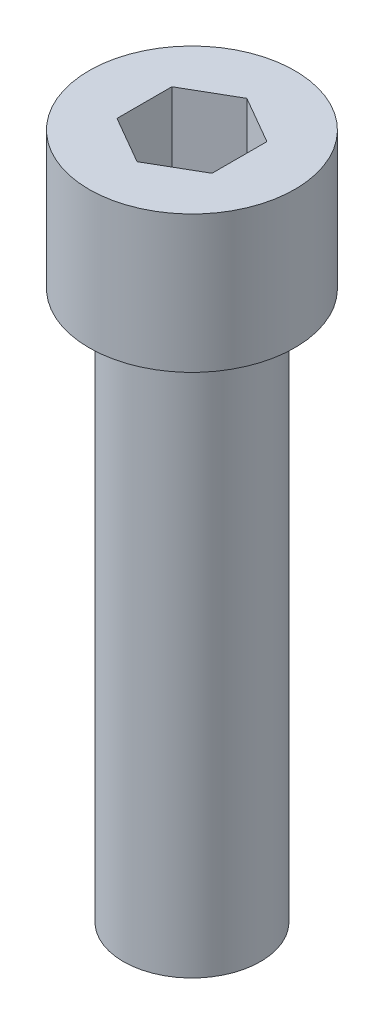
ISO-10303-21;
HEADER;
FILE_DESCRIPTION(('STEP AP214'),'2;1');
FILE_NAME('part.step','',(''),(''),'','','');
FILE_SCHEMA(('AUTOMOTIVE_DESIGN { 1 0 10303 214 1 1 1 1 }'));
ENDSEC;
DATA;
#1=APPLICATION_CONTEXT('core data for automotive mechanical design processes');
#2=APPLICATION_PROTOCOL_DEFINITION('international standard','automotive_design',2000,#1);
#3=PRODUCT_CONTEXT('',#1,'mechanical');
#4=PRODUCT('Part','Part','',(#3));
#5=PRODUCT_RELATED_PRODUCT_CATEGORY('part','',(#4));
#6=PRODUCT_DEFINITION_FORMATION('','',#4);
#7=PRODUCT_DEFINITION_CONTEXT('part definition',#1,'design');
#8=PRODUCT_DEFINITION('design','',#6,#7);
#9=PRODUCT_DEFINITION_SHAPE('','',#8);
#10=(LENGTH_UNIT() NAMED_UNIT(*) SI_UNIT(.MILLI.,.METRE.));
#11=(NAMED_UNIT(*) PLANE_ANGLE_UNIT() SI_UNIT($,.RADIAN.));
#12=(NAMED_UNIT(*) SI_UNIT($,.STERADIAN.) SOLID_ANGLE_UNIT());
#13=UNCERTAINTY_MEASURE_WITH_UNIT(LENGTH_MEASURE(1.E-05),#10,'distance_accuracy_value','');
#14=(GEOMETRIC_REPRESENTATION_CONTEXT(3) GLOBAL_UNCERTAINTY_ASSIGNED_CONTEXT((#13)) GLOBAL_UNIT_ASSIGNED_CONTEXT((#10,
#11,#12)) REPRESENTATION_CONTEXT('',''));
#15=CARTESIAN_POINT('',(0.,0.,0.));
#16=DIRECTION('',(0.,0.,1.));
#17=DIRECTION('',(1.,0.,0.));
#18=AXIS2_PLACEMENT_3D('',#15,#16,#17);
#19=CARTESIAN_POINT('',(-3.17499999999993,-31.7499999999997,-1.73472347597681E-13));
#20=DIRECTION('',(0.,-1.,0.));
#21=DIRECTION('',(0.,0.,-1.));
#22=AXIS2_PLACEMENT_3D('',#19,#20,#21);
#23=PLANE('',#22);
#24=CARTESIAN_POINT('',(0.,-31.7499999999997,0.));
#25=DIRECTION('',(0.,1.,0.));
#26=DIRECTION('',(0.,0.,1.));
#27=AXIS2_PLACEMENT_3D('',#24,#25,#26);
#28=CIRCLE('',#27,3.17499999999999);
#29=CARTESIAN_POINT('',(0.,-31.7499999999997,3.17500000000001));
#30=VERTEX_POINT('',#29);
#31=EDGE_CURVE('E11',#30,#30,#28,.T.);
#32=ORIENTED_EDGE('',*,*,#31,.F.);
#33=EDGE_LOOP('',(#32));
#34=FACE_BOUND('',#33,.T.);
#35=ADVANCED_FACE('F34',(#34),#23,.T.);
#36=CARTESIAN_POINT('',(1.80411241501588E-13,66.04,-2.28983498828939E-13));
#37=DIRECTION('',(0.,1.,0.));
#38=DIRECTION('',(0.,0.,1.));
#39=AXIS2_PLACEMENT_3D('',#36,#37,#38);
#40=CYLINDRICAL_SURFACE('',#39,3.17499999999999);
#41=ORIENTED_EDGE('',*,*,#31,.T.);
#42=EDGE_LOOP('',(#41));
#43=FACE_BOUND('',#42,.T.);
#44=CARTESIAN_POINT('',(1.11022302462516E-13,-6.3500000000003,0.));
#45=DIRECTION('',(0.,1.,0.));
#46=DIRECTION('',(0.,0.,1.));
#47=AXIS2_PLACEMENT_3D('',#44,#45,#46);
#48=CIRCLE('',#47,3.17499999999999);
#49=CARTESIAN_POINT('',(1.08554831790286E-13,-6.3500000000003,3.17500000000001));
#50=VERTEX_POINT('',#49);
#51=EDGE_CURVE('E41',#50,#50,#48,.T.);
#52=ORIENTED_EDGE('',*,*,#51,.F.);
#53=EDGE_LOOP('',(#52));
#54=FACE_BOUND('',#53,.T.);
#55=ADVANCED_FACE('F153',(#43,#54),#40,.T.);
#56=CARTESIAN_POINT('',(-4.76249999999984,-6.3500000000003,-1.2490009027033E-13));
#57=DIRECTION('',(0.,-1.,0.));
#58=DIRECTION('',(0.,0.,-1.));
#59=AXIS2_PLACEMENT_3D('',#56,#57,#58);
#60=PLANE('',#59);
#61=ORIENTED_EDGE('',*,*,#51,.T.);
#62=EDGE_LOOP('',(#61));
#63=FACE_BOUND('',#62,.T.);
#64=CARTESIAN_POINT('',(1.11022302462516E-13,-6.3500000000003,0.));
#65=DIRECTION('',(0.,1.,0.));
#66=DIRECTION('',(0.,0.,1.));
#67=AXIS2_PLACEMENT_3D('',#64,#65,#66);
#68=CIRCLE('',#67,4.76249999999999);
#69=CARTESIAN_POINT('',(1.07321096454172E-13,-6.3500000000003,4.76250000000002));
#70=VERTEX_POINT('',#69);
#71=EDGE_CURVE('E145',#70,#70,#68,.T.);
#72=ORIENTED_EDGE('',*,*,#71,.F.);
#73=EDGE_LOOP('',(#72));
#74=FACE_BOUND('',#73,.T.);
#75=ADVANCED_FACE('F150',(#63,#74),#60,.T.);
#76=CARTESIAN_POINT('',(1.80411241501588E-13,66.04,-2.28983498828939E-13));
#77=DIRECTION('',(0.,1.,0.));
#78=DIRECTION('',(0.,0.,1.));
#79=AXIS2_PLACEMENT_3D('',#76,#77,#78);
#80=CYLINDRICAL_SURFACE('',#79,4.76249999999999);
#81=ORIENTED_EDGE('',*,*,#71,.T.);
#82=EDGE_LOOP('',(#81));
#83=FACE_BOUND('',#82,.T.);
#84=CARTESIAN_POINT('',(0.,0.,0.));
#85=DIRECTION('',(0.,1.,0.));
#86=DIRECTION('',(0.,0.,1.));
#87=AXIS2_PLACEMENT_3D('',#84,#85,#86);
#88=CIRCLE('',#87,4.76249999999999);
#89=CARTESIAN_POINT('',(0.,0.,4.76250000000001));
#90=VERTEX_POINT('',#89);
#91=EDGE_CURVE('E136',#90,#90,#88,.T.);
#92=ORIENTED_EDGE('',*,*,#91,.F.);
#93=EDGE_LOOP('',(#92));
#94=FACE_BOUND('',#93,.T.);
#95=ADVANCED_FACE('F160',(#83,#94),#80,.T.);
#96=CARTESIAN_POINT('',(0.,0.,0.));
#97=DIRECTION('',(0.,1.,0.));
#98=DIRECTION('',(0.,0.,1.));
#99=AXIS2_PLACEMENT_3D('',#96,#97,#98);
#100=PLANE('',#99);
#101=DIRECTION('',(-0.866025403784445,0.,-0.499999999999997));
#102=VECTOR('',#101,1.);
#103=CARTESIAN_POINT('',(2.19970452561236,0.,-1.27));
#104=LINE('',#103,#102);
#105=CARTESIAN_POINT('',(2.19970452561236,0.,-1.27));
#106=VERTEX_POINT('',#105);
#107=CARTESIAN_POINT('',(0.,0.,-2.53999999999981));
#108=VERTEX_POINT('',#107);
#109=EDGE_CURVE('E48',#106,#108,#104,.T.);
#110=ORIENTED_EDGE('',*,*,#109,.F.);
#111=DIRECTION('',(0.,0.,-1.));
#112=VECTOR('',#111,1.);
#113=CARTESIAN_POINT('',(2.19970452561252,-2.22044604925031E-13,1.26999999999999));
#114=LINE('',#113,#112);
#115=CARTESIAN_POINT('',(2.19970452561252,-2.22044604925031E-13,1.26999999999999));
#116=VERTEX_POINT('',#115);
#117=EDGE_CURVE('E118',#116,#106,#114,.T.);
#118=ORIENTED_EDGE('',*,*,#117,.F.);
#119=DIRECTION('',(0.866025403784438,0.,-0.500000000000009));
#120=VECTOR('',#119,1.);
#121=CARTESIAN_POINT('',(1.11022302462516E-13,0.,2.53999999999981));
#122=LINE('',#121,#120);
#123=CARTESIAN_POINT('',(1.11022302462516E-13,0.,2.53999999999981));
#124=VERTEX_POINT('',#123);
#125=EDGE_CURVE('E112',#124,#116,#122,.T.);
#126=ORIENTED_EDGE('',*,*,#125,.F.);
#127=DIRECTION('',(0.866025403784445,0.,0.499999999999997));
#128=VECTOR('',#127,1.);
#129=CARTESIAN_POINT('',(-2.19970452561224,0.,1.2699999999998));
#130=LINE('',#129,#128);
#131=CARTESIAN_POINT('',(-2.19970452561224,0.,1.2699999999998));
#132=VERTEX_POINT('',#131);
#133=EDGE_CURVE('E110',#132,#124,#130,.T.);
#134=ORIENTED_EDGE('',*,*,#133,.F.);
#135=DIRECTION('',(0.,0.,1.));
#136=VECTOR('',#135,1.);
#137=CARTESIAN_POINT('',(-2.1997045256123,-2.22044604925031E-13,-1.27000000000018));
#138=LINE('',#137,#136);
#139=CARTESIAN_POINT('',(-2.1997045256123,-2.22044604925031E-13,-1.27000000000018));
#140=VERTEX_POINT('',#139);
#141=EDGE_CURVE('E91',#140,#132,#138,.T.);
#142=ORIENTED_EDGE('',*,*,#141,.F.);
#143=DIRECTION('',(-0.866025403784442,0.,0.500000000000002));
#144=VECTOR('',#143,1.);
#145=CARTESIAN_POINT('',(0.,0.,-2.53999999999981));
#146=LINE('',#145,#144);
#147=EDGE_CURVE('E102',#108,#140,#146,.T.);
#148=ORIENTED_EDGE('',*,*,#147,.F.);
#149=EDGE_LOOP('',(#110,#118,#126,#134,#142,#148));
#150=FACE_BOUND('',#149,.T.);
#151=ORIENTED_EDGE('',*,*,#91,.T.);
#152=EDGE_LOOP('',(#151));
#153=FACE_BOUND('',#152,.T.);
#154=ADVANCED_FACE('F106',(#150,#153),#100,.T.);
#155=CARTESIAN_POINT('',(2.19970452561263,-6.34999999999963,-1.27));
#156=DIRECTION('',(0.499999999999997,0.,-0.866025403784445));
#157=DIRECTION('',(-0.866025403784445,0.,-0.499999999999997));
#158=AXIS2_PLACEMENT_3D('',#155,#156,#157);
#159=PLANE('',#158);
#160=ORIENTED_EDGE('',*,*,#109,.T.);
#161=DIRECTION('',(0.,1.,0.));
#162=VECTOR('',#161,1.);
#163=CARTESIAN_POINT('',(0.,-6.34999999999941,-2.54000000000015));
#164=LINE('',#163,#162);
#165=CARTESIAN_POINT('',(0.,-6.34999999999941,-2.54000000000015));
#166=VERTEX_POINT('',#165);
#167=EDGE_CURVE('E99',#166,#108,#164,.T.);
#168=ORIENTED_EDGE('',*,*,#167,.F.);
#169=DIRECTION('',(-0.866025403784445,0.,-0.499999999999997));
#170=VECTOR('',#169,1.);
#171=CARTESIAN_POINT('',(2.19970452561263,-6.34999999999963,-1.27));
#172=LINE('',#171,#170);
#173=CARTESIAN_POINT('',(2.19970452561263,-6.34999999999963,-1.27));
#174=VERTEX_POINT('',#173);
#175=EDGE_CURVE('E120',#174,#166,#172,.T.);
#176=ORIENTED_EDGE('',*,*,#175,.F.);
#177=DIRECTION('',(0.,1.,0.));
#178=VECTOR('',#177,1.);
#179=CARTESIAN_POINT('',(2.19970452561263,-6.34999999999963,-1.27));
#180=LINE('',#179,#178);
#181=EDGE_CURVE('E55',#174,#106,#180,.T.);
#182=ORIENTED_EDGE('',*,*,#181,.T.);
#183=EDGE_LOOP('',(#160,#168,#176,#182));
#184=FACE_BOUND('',#183,.T.);
#185=ADVANCED_FACE('F169',(#184),#159,.F.);
#186=CARTESIAN_POINT('',(2.19970452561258,-6.35000000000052,1.26999999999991));
#187=DIRECTION('',(1.00000000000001,0.,0.));
#188=DIRECTION('',(0.,0.,-1.));
#189=AXIS2_PLACEMENT_3D('',#186,#187,#188);
#190=PLANE('',#189);
#191=ORIENTED_EDGE('',*,*,#117,.T.);
#192=ORIENTED_EDGE('',*,*,#181,.F.);
#193=DIRECTION('',(0.,0.,-1.));
#194=VECTOR('',#193,1.);
#195=CARTESIAN_POINT('',(2.19970452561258,-6.35000000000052,1.26999999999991));
#196=LINE('',#195,#194);
#197=CARTESIAN_POINT('',(2.19970452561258,-6.35000000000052,1.26999999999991));
#198=VERTEX_POINT('',#197);
#199=EDGE_CURVE('E132',#198,#174,#196,.T.);
#200=ORIENTED_EDGE('',*,*,#199,.F.);
#201=DIRECTION('',(0.,1.,0.));
#202=VECTOR('',#201,1.);
#203=CARTESIAN_POINT('',(2.19970452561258,-6.35000000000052,1.26999999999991));
#204=LINE('',#203,#202);
#205=EDGE_CURVE('E137',#198,#116,#204,.T.);
#206=ORIENTED_EDGE('',*,*,#205,.T.);
#207=EDGE_LOOP('',(#191,#192,#200,#206));
#208=FACE_BOUND('',#207,.T.);
#209=ADVANCED_FACE('F172',(#208),#190,.F.);
#210=CARTESIAN_POINT('',(0.,-6.3500000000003,2.53999999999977));
#211=DIRECTION('',(0.500000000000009,0.,0.866025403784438));
#212=DIRECTION('',(0.866025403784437,0.,-0.500000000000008));
#213=AXIS2_PLACEMENT_3D('',#210,#211,#212);
#214=PLANE('',#213);
#215=ORIENTED_EDGE('',*,*,#125,.T.);
#216=ORIENTED_EDGE('',*,*,#205,.F.);
#217=DIRECTION('',(0.866025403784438,0.,-0.500000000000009));
#218=VECTOR('',#217,1.);
#219=CARTESIAN_POINT('',(0.,-6.3500000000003,2.53999999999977));
#220=LINE('',#219,#218);
#221=CARTESIAN_POINT('',(0.,-6.3500000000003,2.53999999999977));
#222=VERTEX_POINT('',#221);
#223=EDGE_CURVE('E129',#222,#198,#220,.T.);
#224=ORIENTED_EDGE('',*,*,#223,.F.);
#225=DIRECTION('',(0.,1.,0.));
#226=VECTOR('',#225,1.);
#227=CARTESIAN_POINT('',(0.,-6.3500000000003,2.53999999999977));
#228=LINE('',#227,#226);
#229=EDGE_CURVE('E139',#222,#124,#228,.T.);
#230=ORIENTED_EDGE('',*,*,#229,.T.);
#231=EDGE_LOOP('',(#215,#216,#224,#230));
#232=FACE_BOUND('',#231,.T.);
#233=ADVANCED_FACE('F181',(#232),#214,.F.);
#234=CARTESIAN_POINT('',(-2.19970452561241,-6.3500000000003,1.26999999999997));
#235=DIRECTION('',(-0.499999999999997,0.,0.866025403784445));
#236=DIRECTION('',(0.866025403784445,0.,0.499999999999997));
#237=AXIS2_PLACEMENT_3D('',#234,#235,#236);
#238=PLANE('',#237);
#239=ORIENTED_EDGE('',*,*,#133,.T.);
#240=ORIENTED_EDGE('',*,*,#229,.F.);
#241=DIRECTION('',(0.866025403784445,0.,0.499999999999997));
#242=VECTOR('',#241,1.);
#243=CARTESIAN_POINT('',(-2.19970452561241,-6.3500000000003,1.26999999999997));
#244=LINE('',#243,#242);
#245=CARTESIAN_POINT('',(-2.19970452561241,-6.3500000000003,1.26999999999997));
#246=VERTEX_POINT('',#245);
#247=EDGE_CURVE('E126',#246,#222,#244,.T.);
#248=ORIENTED_EDGE('',*,*,#247,.F.);
#249=DIRECTION('',(0.,1.,0.));
#250=VECTOR('',#249,1.);
#251=CARTESIAN_POINT('',(-2.19970452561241,-6.3500000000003,1.26999999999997));
#252=LINE('',#251,#250);
#253=EDGE_CURVE('E98',#246,#132,#252,.T.);
#254=ORIENTED_EDGE('',*,*,#253,.T.);
#255=EDGE_LOOP('',(#239,#240,#248,#254));
#256=FACE_BOUND('',#255,.T.);
#257=ADVANCED_FACE('F178',(#256),#238,.F.);
#258=CARTESIAN_POINT('',(-2.19970452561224,-6.3500000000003,-1.27000000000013));
#259=DIRECTION('',(-1.,0.,0.));
#260=DIRECTION('',(0.,0.,1.));
#261=AXIS2_PLACEMENT_3D('',#258,#259,#260);
#262=PLANE('',#261);
#263=ORIENTED_EDGE('',*,*,#141,.T.);
#264=ORIENTED_EDGE('',*,*,#253,.F.);
#265=DIRECTION('',(0.,0.,1.));
#266=VECTOR('',#265,1.);
#267=CARTESIAN_POINT('',(-2.19970452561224,-6.3500000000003,-1.27000000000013));
#268=LINE('',#267,#266);
#269=CARTESIAN_POINT('',(-2.19970452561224,-6.3500000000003,-1.27000000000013));
#270=VERTEX_POINT('',#269);
#271=EDGE_CURVE('E94',#270,#246,#268,.T.);
#272=ORIENTED_EDGE('',*,*,#271,.F.);
#273=DIRECTION('',(0.,1.,0.));
#274=VECTOR('',#273,1.);
#275=CARTESIAN_POINT('',(-2.19970452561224,-6.3500000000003,-1.27000000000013));
#276=LINE('',#275,#274);
#277=EDGE_CURVE('E87',#270,#140,#276,.T.);
#278=ORIENTED_EDGE('',*,*,#277,.T.);
#279=EDGE_LOOP('',(#263,#264,#272,#278));
#280=FACE_BOUND('',#279,.T.);
#281=ADVANCED_FACE('F89',(#280),#262,.F.);
#282=CARTESIAN_POINT('',(0.,-6.34999999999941,-2.54000000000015));
#283=DIRECTION('',(-0.500000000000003,0.,-0.866025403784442));
#284=DIRECTION('',(-0.866025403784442,0.,0.500000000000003));
#285=AXIS2_PLACEMENT_3D('',#282,#283,#284);
#286=PLANE('',#285);
#287=ORIENTED_EDGE('',*,*,#147,.T.);
#288=ORIENTED_EDGE('',*,*,#277,.F.);
#289=DIRECTION('',(-0.866025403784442,0.,0.500000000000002));
#290=VECTOR('',#289,1.);
#291=CARTESIAN_POINT('',(0.,-6.34999999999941,-2.54000000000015));
#292=LINE('',#291,#290);
#293=EDGE_CURVE('E123',#166,#270,#292,.T.);
#294=ORIENTED_EDGE('',*,*,#293,.F.);
#295=ORIENTED_EDGE('',*,*,#167,.T.);
#296=EDGE_LOOP('',(#287,#288,#294,#295));
#297=FACE_BOUND('',#296,.T.);
#298=ADVANCED_FACE('F103',(#297),#286,.F.);
#299=CARTESIAN_POINT('',(4.39940905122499,-6.3500000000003,-1.59594559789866E-13));
#300=DIRECTION('',(0.,-1.,0.));
#301=DIRECTION('',(0.,0.,-1.));
#302=AXIS2_PLACEMENT_3D('',#299,#300,#301);
#303=PLANE('',#302);
#304=ORIENTED_EDGE('',*,*,#175,.T.);
#305=ORIENTED_EDGE('',*,*,#293,.T.);
#306=ORIENTED_EDGE('',*,*,#271,.T.);
#307=ORIENTED_EDGE('',*,*,#247,.T.);
#308=ORIENTED_EDGE('',*,*,#223,.T.);
#309=ORIENTED_EDGE('',*,*,#199,.T.);
#310=EDGE_LOOP('',(#304,#305,#306,#307,#308,#309));
#311=FACE_BOUND('',#310,.T.);
#312=ADVANCED_FACE('F175',(#311),#303,.F.);
#313=CLOSED_SHELL('',(#35,#55,#75,#95,#154,#185,#209,#233,#257,#281,#298,#312));
#314=MANIFOLD_SOLID_BREP('B2',#313);
#315=ADVANCED_BREP_SHAPE_REPRESENTATION('',(#18,#314),#14);
#316=SHAPE_DEFINITION_REPRESENTATION(#9,#315);
ENDSEC;
END-ISO-10303-21;
